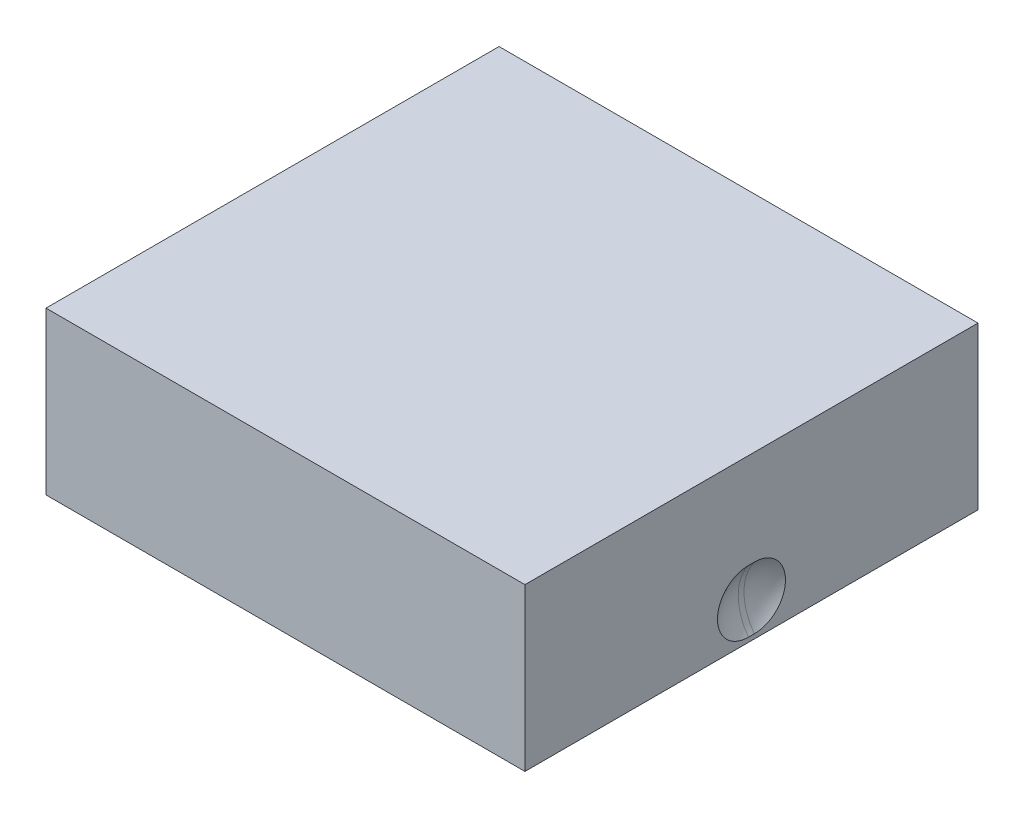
ISO-10303-21;
HEADER;
FILE_DESCRIPTION(('STEP AP214'),'2;1');
FILE_NAME('part.step','',(''),(''),'','','');
FILE_SCHEMA(('AUTOMOTIVE_DESIGN { 1 0 10303 214 1 1 1 1 }'));
ENDSEC;
DATA;
#1=APPLICATION_CONTEXT('core data for automotive mechanical design processes');
#2=APPLICATION_PROTOCOL_DEFINITION('international standard','automotive_design',2000,#1);
#3=PRODUCT_CONTEXT('',#1,'mechanical');
#4=PRODUCT('Part','Part','',(#3));
#5=PRODUCT_RELATED_PRODUCT_CATEGORY('part','',(#4));
#6=PRODUCT_DEFINITION_FORMATION('','',#4);
#7=PRODUCT_DEFINITION_CONTEXT('part definition',#1,'design');
#8=PRODUCT_DEFINITION('design','',#6,#7);
#9=PRODUCT_DEFINITION_SHAPE('','',#8);
#10=(LENGTH_UNIT() NAMED_UNIT(*) SI_UNIT(.MILLI.,.METRE.));
#11=(NAMED_UNIT(*) PLANE_ANGLE_UNIT() SI_UNIT($,.RADIAN.));
#12=(NAMED_UNIT(*) SI_UNIT($,.STERADIAN.) SOLID_ANGLE_UNIT());
#13=UNCERTAINTY_MEASURE_WITH_UNIT(LENGTH_MEASURE(1.E-05),#10,'distance_accuracy_value','');
#14=(GEOMETRIC_REPRESENTATION_CONTEXT(3) GLOBAL_UNCERTAINTY_ASSIGNED_CONTEXT((#13)) GLOBAL_UNIT_ASSIGNED_CONTEXT((#10,
#11,#12)) REPRESENTATION_CONTEXT('',''));
#15=CARTESIAN_POINT('',(0.,0.,0.));
#16=DIRECTION('',(0.,0.,1.));
#17=DIRECTION('',(1.,0.,0.));
#18=AXIS2_PLACEMENT_3D('',#15,#16,#17);
#19=CARTESIAN_POINT('',(50.,120.,0.));
#20=DIRECTION('',(0.,1.,0.));
#21=DIRECTION('',(0.,0.,1.));
#22=AXIS2_PLACEMENT_3D('',#19,#20,#21);
#23=PLANE('',#22);
#24=DIRECTION('',(0.,0.,-1.));
#25=VECTOR('',#24,1.);
#26=CARTESIAN_POINT('',(74.,120.,-70.));
#27=LINE('',#26,#25);
#28=CARTESIAN_POINT('',(74.,120.,-70.));
#29=VERTEX_POINT('',#28);
#30=CARTESIAN_POINT('',(74.,120.,70.));
#31=VERTEX_POINT('',#30);
#32=EDGE_CURVE('E92',#29,#31,#27,.F.);
#33=ORIENTED_EDGE('',*,*,#32,.F.);
#34=DIRECTION('',(-1.,0.,0.));
#35=VECTOR('',#34,1.);
#36=CARTESIAN_POINT('',(-74.,120.,-70.));
#37=LINE('',#36,#35);
#38=CARTESIAN_POINT('',(-74.,120.,-70.));
#39=VERTEX_POINT('',#38);
#40=EDGE_CURVE('E102',#39,#29,#37,.F.);
#41=ORIENTED_EDGE('',*,*,#40,.F.);
#42=DIRECTION('',(0.,0.,1.));
#43=VECTOR('',#42,1.);
#44=CARTESIAN_POINT('',(-74.,120.,70.));
#45=LINE('',#44,#43);
#46=CARTESIAN_POINT('',(-74.,120.,70.));
#47=VERTEX_POINT('',#46);
#48=EDGE_CURVE('E108',#47,#39,#45,.F.);
#49=ORIENTED_EDGE('',*,*,#48,.F.);
#50=DIRECTION('',(1.,0.,0.));
#51=VECTOR('',#50,1.);
#52=CARTESIAN_POINT('',(74.,120.,70.));
#53=LINE('',#52,#51);
#54=EDGE_CURVE('E107',#31,#47,#53,.F.);
#55=ORIENTED_EDGE('',*,*,#54,.F.);
#56=EDGE_LOOP('',(#33,#41,#49,#55));
#57=FACE_BOUND('',#56,.T.);
#58=ADVANCED_FACE('F14',(#57),#23,.T.);
#59=CARTESIAN_POINT('',(50.,115.,0.));
#60=DIRECTION('',(0.,1.,0.));
#61=DIRECTION('',(0.,0.,1.));
#62=AXIS2_PLACEMENT_3D('',#59,#60,#61);
#63=PLANE('',#62);
#64=CARTESIAN_POINT('',(50.,115.,0.));
#65=DIRECTION('',(0.,-1.,0.));
#66=DIRECTION('',(0.,0.,-1.));
#67=AXIS2_PLACEMENT_3D('',#64,#65,#66);
#68=CIRCLE('',#67,9.);
#69=CARTESIAN_POINT('',(50.,115.,-9.));
#70=VERTEX_POINT('',#69);
#71=EDGE_CURVE('E9',#70,#70,#68,.F.);
#72=ORIENTED_EDGE('',*,*,#71,.F.);
#73=EDGE_LOOP('',(#72));
#74=FACE_BOUND('',#73,.T.);
#75=ADVANCED_FACE('F175',(#74),#63,.F.);
#76=CARTESIAN_POINT('',(-50.,115.,0.));
#77=DIRECTION('',(0.,1.,0.));
#78=DIRECTION('',(0.,0.,1.));
#79=AXIS2_PLACEMENT_3D('',#76,#77,#78);
#80=PLANE('',#79);
#81=CARTESIAN_POINT('',(-50.,115.,0.));
#82=DIRECTION('',(0.,1.,0.));
#83=DIRECTION('',(0.,0.,1.));
#84=AXIS2_PLACEMENT_3D('',#81,#82,#83);
#85=CIRCLE('',#84,9.);
#86=CARTESIAN_POINT('',(-50.,115.,9.));
#87=VERTEX_POINT('',#86);
#88=EDGE_CURVE('E23',#87,#87,#85,.T.);
#89=ORIENTED_EDGE('',*,*,#88,.F.);
#90=EDGE_LOOP('',(#89));
#91=FACE_BOUND('',#90,.T.);
#92=ADVANCED_FACE('F172',(#91),#80,.F.);
#93=CARTESIAN_POINT('',(-50.,97.5,0.));
#94=DIRECTION('',(0.,1.,0.));
#95=DIRECTION('',(0.,0.,1.));
#96=AXIS2_PLACEMENT_3D('',#93,#94,#95);
#97=CYLINDRICAL_SURFACE('',#96,9.);
#98=ORIENTED_EDGE('',*,*,#88,.T.);
#99=EDGE_LOOP('',(#98));
#100=FACE_BOUND('',#99,.T.);
#101=CARTESIAN_POINT('',(-50.,80.,0.));
#102=DIRECTION('',(0.,1.,0.));
#103=DIRECTION('',(0.,0.,1.));
#104=AXIS2_PLACEMENT_3D('',#101,#102,#103);
#105=CIRCLE('',#104,9.);
#106=CARTESIAN_POINT('',(-50.,80.,9.));
#107=VERTEX_POINT('',#106);
#108=EDGE_CURVE('E17',#107,#107,#105,.F.);
#109=ORIENTED_EDGE('',*,*,#108,.T.);
#110=EDGE_LOOP('',(#109));
#111=FACE_BOUND('',#110,.T.);
#112=ADVANCED_FACE('F174',(#100,#111),#97,.F.);
#113=CARTESIAN_POINT('',(-57.125,80.,0.));
#114=DIRECTION('',(0.,-1.,0.));
#115=DIRECTION('',(0.,0.,-1.));
#116=AXIS2_PLACEMENT_3D('',#113,#114,#115);
#117=PLANE('',#116);
#118=CARTESIAN_POINT('',(-50.,80.,0.));
#119=DIRECTION('',(0.,1.,0.));
#120=DIRECTION('',(0.,0.,1.));
#121=AXIS2_PLACEMENT_3D('',#118,#119,#120);
#122=CIRCLE('',#121,5.25);
#123=CARTESIAN_POINT('',(-50.,80.,5.25));
#124=VERTEX_POINT('',#123);
#125=EDGE_CURVE('E302',#124,#124,#122,.F.);
#126=ORIENTED_EDGE('',*,*,#125,.T.);
#127=EDGE_LOOP('',(#126));
#128=FACE_BOUND('',#127,.T.);
#129=ORIENTED_EDGE('',*,*,#108,.F.);
#130=EDGE_LOOP('',(#129));
#131=FACE_BOUND('',#130,.T.);
#132=ADVANCED_FACE('F187',(#128,#131),#117,.F.);
#133=CARTESIAN_POINT('',(-50.,72.1,0.));
#134=DIRECTION('',(0.,1.,0.));
#135=DIRECTION('',(0.,0.,1.));
#136=AXIS2_PLACEMENT_3D('',#133,#134,#135);
#137=CYLINDRICAL_SURFACE('',#136,5.25);
#138=ORIENTED_EDGE('',*,*,#125,.F.);
#139=EDGE_LOOP('',(#138));
#140=FACE_BOUND('',#139,.T.);
#141=CARTESIAN_POINT('',(-50.,64.3,0.));
#142=DIRECTION('',(0.,1.,0.));
#143=DIRECTION('',(0.,0.,1.));
#144=AXIS2_PLACEMENT_3D('',#141,#142,#143);
#145=CIRCLE('',#144,5.25);
#146=CARTESIAN_POINT('',(-50.,64.3,5.25));
#147=VERTEX_POINT('',#146);
#148=EDGE_CURVE('E296',#147,#147,#145,.T.);
#149=ORIENTED_EDGE('',*,*,#148,.F.);
#150=EDGE_LOOP('',(#149));
#151=FACE_BOUND('',#150,.T.);
#152=ADVANCED_FACE('F195',(#140,#151),#137,.F.);
#153=CARTESIAN_POINT('',(-54.5,64.3,0.));
#154=DIRECTION('',(0.,-1.,0.));
#155=DIRECTION('',(0.,0.,-1.));
#156=AXIS2_PLACEMENT_3D('',#153,#154,#155);
#157=PLANE('',#156);
#158=CARTESIAN_POINT('',(-50.,64.3,0.));
#159=DIRECTION('',(0.,1.,0.));
#160=DIRECTION('',(0.,0.,1.));
#161=AXIS2_PLACEMENT_3D('',#158,#159,#160);
#162=CIRCLE('',#161,9.);
#163=CARTESIAN_POINT('',(-50.,64.3,9.));
#164=VERTEX_POINT('',#163);
#165=EDGE_CURVE('E284',#164,#164,#162,.T.);
#166=ORIENTED_EDGE('',*,*,#165,.F.);
#167=EDGE_LOOP('',(#166));
#168=FACE_BOUND('',#167,.T.);
#169=ORIENTED_EDGE('',*,*,#148,.T.);
#170=EDGE_LOOP('',(#169));
#171=FACE_BOUND('',#170,.T.);
#172=ADVANCED_FACE('F216',(#168,#171),#157,.T.);
#173=CARTESIAN_POINT('',(-50.,67.15,0.));
#174=DIRECTION('',(0.,1.,0.));
#175=DIRECTION('',(0.,0.,1.));
#176=AXIS2_PLACEMENT_3D('',#173,#174,#175);
#177=CYLINDRICAL_SURFACE('',#176,9.);
#178=ORIENTED_EDGE('',*,*,#165,.T.);
#179=EDGE_LOOP('',(#178));
#180=FACE_BOUND('',#179,.T.);
#181=CARTESIAN_POINT('',(-50.,70.,0.));
#182=DIRECTION('',(0.,1.,0.));
#183=DIRECTION('',(0.,0.,1.));
#184=AXIS2_PLACEMENT_3D('',#181,#182,#183);
#185=CIRCLE('',#184,9.);
#186=CARTESIAN_POINT('',(-50.,70.,9.));
#187=VERTEX_POINT('',#186);
#188=EDGE_CURVE('E120',#187,#187,#185,.F.);
#189=ORIENTED_EDGE('',*,*,#188,.T.);
#190=EDGE_LOOP('',(#189));
#191=FACE_BOUND('',#190,.T.);
#192=ADVANCED_FACE('F224',(#180,#191),#177,.T.);
#193=CARTESIAN_POINT('',(50.,67.15,0.));
#194=DIRECTION('',(0.,-1.,0.));
#195=DIRECTION('',(0.,0.,-1.));
#196=AXIS2_PLACEMENT_3D('',#193,#194,#195);
#197=CYLINDRICAL_SURFACE('',#196,9.);
#198=CARTESIAN_POINT('',(50.,64.3,0.));
#199=DIRECTION('',(0.,-1.,0.));
#200=DIRECTION('',(0.,0.,-1.));
#201=AXIS2_PLACEMENT_3D('',#198,#199,#200);
#202=CIRCLE('',#201,9.);
#203=CARTESIAN_POINT('',(50.,64.3,-9.));
#204=VERTEX_POINT('',#203);
#205=EDGE_CURVE('E98',#204,#204,#202,.F.);
#206=ORIENTED_EDGE('',*,*,#205,.T.);
#207=EDGE_LOOP('',(#206));
#208=FACE_BOUND('',#207,.T.);
#209=CARTESIAN_POINT('',(50.,70.,0.));
#210=DIRECTION('',(0.,-1.,0.));
#211=DIRECTION('',(0.,0.,-1.));
#212=AXIS2_PLACEMENT_3D('',#209,#210,#211);
#213=CIRCLE('',#212,9.);
#214=CARTESIAN_POINT('',(50.,70.,-9.));
#215=VERTEX_POINT('',#214);
#216=EDGE_CURVE('E134',#215,#215,#213,.T.);
#217=ORIENTED_EDGE('',*,*,#216,.T.);
#218=EDGE_LOOP('',(#217));
#219=FACE_BOUND('',#218,.T.);
#220=ADVANCED_FACE('F259',(#208,#219),#197,.T.);
#221=CARTESIAN_POINT('',(-86.8,81.,-0.900000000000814));
#222=DIRECTION('',(0.633979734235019,0.762368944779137,0.129858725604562));
#223=DIRECTION('',(-0.762337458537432,0.644314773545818,-0.0608282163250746));
#224=AXIS2_PLACEMENT_3D('',#221,#222,#223);
#225=SPHERICAL_SURFACE('',#224,16.);
#226=CARTESIAN_POINT('',(-86.8,81.,-0.9));
#227=DIRECTION('',(0.,0.,1.));
#228=DIRECTION('',(1.,0.,0.));
#229=AXIS2_PLACEMENT_3D('',#226,#227,#228);
#230=CIRCLE('',#229,16.);
#231=CARTESIAN_POINT('',(-74.,71.4,-0.9));
#232=VERTEX_POINT('',#231);
#233=CARTESIAN_POINT('',(-74.,90.6,-0.9));
#234=VERTEX_POINT('',#233);
#235=EDGE_CURVE('E285',#232,#234,#230,.T.);
#236=ORIENTED_EDGE('',*,*,#235,.T.);
#237=CARTESIAN_POINT('',(-74.,71.3999999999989,-0.9));
#238=CARTESIAN_POINT('',(-74.,71.3999709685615,-1.1700030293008));
#239=CARTESIAN_POINT('',(-74.,71.4113896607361,-1.44000188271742));
#240=CARTESIAN_POINT('',(-74.,71.4569128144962,-1.97806793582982));
#241=CARTESIAN_POINT('',(-74.,71.491016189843,-2.24613522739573));
#242=CARTESIAN_POINT('',(-74.,71.5816671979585,-2.77825399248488));
#243=CARTESIAN_POINT('',(-74.,71.6381990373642,-3.04230815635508));
#244=CARTESIAN_POINT('',(-74.,71.773295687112,-3.56471500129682));
#245=CARTESIAN_POINT('',(-74.,71.8518602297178,-3.82306775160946));
#246=CARTESIAN_POINT('',(-74.,72.0305080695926,-4.33235682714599));
#247=CARTESIAN_POINT('',(-74.,72.1306012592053,-4.58328968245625));
#248=CARTESIAN_POINT('',(-74.,72.3515750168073,-5.07583571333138));
#249=CARTESIAN_POINT('',(-74.,72.4724560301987,-5.31744868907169));
#250=CARTESIAN_POINT('',(-74.,72.7341176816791,-5.78958271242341));
#251=CARTESIAN_POINT('',(-74.,72.8748942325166,-6.0201060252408));
#252=CARTESIAN_POINT('',(-74.,73.1753642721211,-6.46847415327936));
#253=CARTESIAN_POINT('',(-74.,73.3350576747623,-6.68631902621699));
#254=CARTESIAN_POINT('',(-74.,73.6722327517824,-7.10779034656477));
#255=CARTESIAN_POINT('',(-74.,73.8497150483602,-7.31141629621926));
#256=CARTESIAN_POINT('',(-74.,74.2211976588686,-7.70298975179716));
#257=CARTESIAN_POINT('',(-74.,74.4151976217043,-7.89093759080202));
#258=CARTESIAN_POINT('',(-74.,74.8183728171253,-8.24985305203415));
#259=CARTESIAN_POINT('',(-74.,75.0275505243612,-8.4208178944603));
#260=CARTESIAN_POINT('',(-74.,75.4595657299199,-8.74451672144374));
#261=CARTESIAN_POINT('',(-74.,75.6824032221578,-8.89725071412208));
#262=CARTESIAN_POINT('',(-74.,76.1401435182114,-9.18339562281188));
#263=CARTESIAN_POINT('',(-74.,76.3750457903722,-9.31680738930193));
#264=CARTESIAN_POINT('',(-74.,76.8552545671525,-9.56336732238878));
#265=CARTESIAN_POINT('',(-74.,77.100561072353,-9.67651548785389));
#266=CARTESIAN_POINT('',(-74.,77.5998181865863,-9.88173715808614));
#267=CARTESIAN_POINT('',(-74.,77.853768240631,-9.97381201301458));
#268=CARTESIAN_POINT('',(-74.,78.3685220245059,-10.1362417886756));
#269=CARTESIAN_POINT('',(-74.,78.6293257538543,-10.2065967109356));
#270=CARTESIAN_POINT('',(-74.,79.1559382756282,-10.3250876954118));
#271=CARTESIAN_POINT('',(-74.,79.421747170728,-10.3732233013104));
#272=CARTESIAN_POINT('',(-74.,79.9564751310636,-10.446931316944));
#273=CARTESIAN_POINT('',(-74.,80.2253941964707,-10.472503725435));
#274=CARTESIAN_POINT('',(-74.,80.7644368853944,-10.5009038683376));
#275=CARTESIAN_POINT('',(-74.,81.0345605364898,-10.5037310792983));
#276=CARTESIAN_POINT('',(-74.,81.5740857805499,-10.4866193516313));
#277=CARTESIAN_POINT('',(-74.,81.8434873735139,-10.4666804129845));
#278=CARTESIAN_POINT('',(-74.,82.3796505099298,-10.4041784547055));
#279=CARTESIAN_POINT('',(-74.,82.6464120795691,-10.3616156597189));
#280=CARTESIAN_POINT('',(-74.,83.175401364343,-10.254168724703));
#281=CARTESIAN_POINT('',(-74.,83.4376290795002,-10.1892845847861));
#282=CARTESIAN_POINT('',(-74.,83.9556855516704,-10.0376564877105));
#283=CARTESIAN_POINT('',(-74.,84.2115143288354,-9.95091259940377));
#284=CARTESIAN_POINT('',(-74.,84.7149549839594,-9.75618160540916));
#285=CARTESIAN_POINT('',(-74.,84.9625668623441,-9.64819450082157));
#286=CARTESIAN_POINT('',(-74.,85.4478197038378,-9.41174170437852));
#287=CARTESIAN_POINT('',(-74.,85.6854604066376,-9.28327547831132));
#288=CARTESIAN_POINT('',(-74.,86.1490745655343,-9.00677976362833));
#289=CARTESIAN_POINT('',(-74.,86.3750480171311,-8.85875026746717));
#290=CARTESIAN_POINT('',(-74.,86.8137102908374,-8.5441881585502));
#291=CARTESIAN_POINT('',(-74.,87.0263997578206,-8.3776564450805));
#292=CARTESIAN_POINT('',(-74.,87.4369936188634,-8.02726825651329));
#293=CARTESIAN_POINT('',(-74.,87.6348980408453,-7.8434118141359));
#294=CARTESIAN_POINT('',(-74.,88.0144879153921,-7.45970867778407));
#295=CARTESIAN_POINT('',(-74.,88.1961757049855,-7.25986429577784));
#296=CARTESIAN_POINT('',(-74.,88.5420768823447,-6.84557802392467));
#297=CARTESIAN_POINT('',(-74.,88.7062898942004,-6.63113582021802));
#298=CARTESIAN_POINT('',(-74.,89.0161199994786,-6.18911041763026));
#299=CARTESIAN_POINT('',(-74.,89.1617310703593,-5.96152299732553));
#300=CARTESIAN_POINT('',(-74.,89.433255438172,-5.49489573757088));
#301=CARTESIAN_POINT('',(-74.,89.5591693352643,-5.25585624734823));
#302=CARTESIAN_POINT('',(-74.,89.7904830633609,-4.76786320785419));
#303=CARTESIAN_POINT('',(-74.,89.8958697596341,-4.51890343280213));
#304=CARTESIAN_POINT('',(-74.,90.0852761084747,-4.01299030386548));
#305=CARTESIAN_POINT('',(-74.,90.1692963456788,-3.75603716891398));
#306=CARTESIAN_POINT('',(-74.,90.3152815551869,-3.23630141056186));
#307=CARTESIAN_POINT('',(-74.,90.377274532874,-2.97352664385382));
#308=CARTESIAN_POINT('',(-74.,90.4788912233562,-2.44379460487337));
#309=CARTESIAN_POINT('',(-74.,90.5185259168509,-2.17683945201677));
#310=CARTESIAN_POINT('',(-74.,90.5645706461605,-1.74108609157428));
#311=CARTESIAN_POINT('',(-74.,90.5778651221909,-1.57298540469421));
#312=CARTESIAN_POINT('',(-74.,90.5955734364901,-1.23659564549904));
#313=CARTESIAN_POINT('',(-74.,90.6000019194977,-1.06830734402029));
#314=CARTESIAN_POINT('',(-74.,90.6000000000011,-0.899999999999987));
#315=B_SPLINE_CURVE_WITH_KNOTS('',3,(#237,#238,#239,#240,#241,#242,#243,#244,#245,#246,#247,
#248,#249,#250,#251,#252,#253,#254,#255,#256,#257,#258,#259,#260,#261,#262,#263,#264,#265,#266,
#267,#268,#269,#270,#271,#272,#273,#274,#275,#276,#277,#278,#279,#280,#281,#282,#283,#284,#285,
#286,#287,#288,#289,#290,#291,#292,#293,#294,#295,#296,#297,#298,#299,#300,#301,#302,#303,#304,
#305,#306,#307,#308,#309,#310,#311,#312,#313,#314),.UNSPECIFIED.,.F.,.F.,(4,2,2,2,2,2,2,2,2,2,2,
2,2,2,2,2,2,2,2,2,2,2,2,2,2,2,2,2,2,2,2,2,2,2,2,2,2,2,4),(0.,0.809761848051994,1.61948492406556,
2.42863882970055,3.23778290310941,4.04729957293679,4.8568335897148,5.66620154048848,
6.47556580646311,7.28495839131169,8.09433377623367,8.9038414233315,9.71334870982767,
10.522820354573,11.3322920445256,12.1417118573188,12.9511316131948,13.760567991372,
14.5700044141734,15.3794594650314,16.1889145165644,16.9983615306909,17.8078085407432,
18.6172530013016,19.4266974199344,20.2361629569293,21.0456288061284,21.8550553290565,
22.6644803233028,23.4737884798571,24.2831140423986,25.0927009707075,25.9022632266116,
26.7123418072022,27.5223982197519,28.3314210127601,29.1400461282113,29.6457079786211,
30.1505338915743),.UNSPECIFIED.);
#316=EDGE_CURVE('E114',#232,#234,#315,.T.);
#317=ORIENTED_EDGE('',*,*,#316,.F.);
#318=EDGE_LOOP('',(#236,#317));
#319=FACE_BOUND('',#318,.T.);
#320=ADVANCED_FACE('F244',(#319),#225,.F.);
#321=CARTESIAN_POINT('',(-86.8,81.,0.900000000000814));
#322=DIRECTION('',(0.633979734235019,0.762368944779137,0.129858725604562));
#323=DIRECTION('',(-0.762337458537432,0.644314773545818,-0.0608282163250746));
#324=AXIS2_PLACEMENT_3D('',#321,#322,#323);
#325=SPHERICAL_SURFACE('',#324,16.);
#326=CARTESIAN_POINT('',(-86.8,81.,0.9));
#327=DIRECTION('',(0.,0.,1.));
#328=DIRECTION('',(1.,0.,0.));
#329=AXIS2_PLACEMENT_3D('',#326,#327,#328);
#330=CIRCLE('',#329,16.);
#331=CARTESIAN_POINT('',(-74.,71.4,0.9));
#332=VERTEX_POINT('',#331);
#333=CARTESIAN_POINT('',(-74.,90.6,0.9));
#334=VERTEX_POINT('',#333);
#335=EDGE_CURVE('E281',#332,#334,#330,.T.);
#336=ORIENTED_EDGE('',*,*,#335,.F.);
#337=CARTESIAN_POINT('',(-74.,90.6000000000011,0.9));
#338=CARTESIAN_POINT('',(-74.,90.6000290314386,1.17000302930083));
#339=CARTESIAN_POINT('',(-74.,90.588610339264,1.44000188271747));
#340=CARTESIAN_POINT('',(-74.,90.5430871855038,1.97806793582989));
#341=CARTESIAN_POINT('',(-74.,90.5089838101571,2.24613522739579));
#342=CARTESIAN_POINT('',(-74.,90.4183328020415,2.77825399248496));
#343=CARTESIAN_POINT('',(-74.,90.3618009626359,3.04230815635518));
#344=CARTESIAN_POINT('',(-74.,90.2267043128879,3.56471500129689));
#345=CARTESIAN_POINT('',(-74.,90.1481397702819,3.82306775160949));
#346=CARTESIAN_POINT('',(-74.,89.9694919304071,4.33235682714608));
#347=CARTESIAN_POINT('',(-74.,89.8693987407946,4.58328968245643));
#348=CARTESIAN_POINT('',(-74.,89.6484249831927,5.07583571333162));
#349=CARTESIAN_POINT('',(-74.,89.5275439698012,5.3174486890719));
#350=CARTESIAN_POINT('',(-74.,89.2658823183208,5.78958271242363));
#351=CARTESIAN_POINT('',(-74.,89.1251057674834,6.02010602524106));
#352=CARTESIAN_POINT('',(-74.,88.8246357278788,6.46847415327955));
#353=CARTESIAN_POINT('',(-74.,88.6649423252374,6.68631902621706));
#354=CARTESIAN_POINT('',(-74.,88.3277672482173,7.10779034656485));
#355=CARTESIAN_POINT('',(-74.,88.1502849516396,7.31141629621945));
#356=CARTESIAN_POINT('',(-74.,87.7788023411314,7.70298975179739));
#357=CARTESIAN_POINT('',(-74.,87.5848023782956,7.89093759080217));
#358=CARTESIAN_POINT('',(-74.,87.1816271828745,8.24985305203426));
#359=CARTESIAN_POINT('',(-74.,86.9724494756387,8.42081789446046));
#360=CARTESIAN_POINT('',(-74.,86.54043427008,8.74451672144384));
#361=CARTESIAN_POINT('',(-74.,86.317596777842,8.89725071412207));
#362=CARTESIAN_POINT('',(-74.,85.8598564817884,9.18339562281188));
#363=CARTESIAN_POINT('',(-74.,85.6249542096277,9.31680738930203));
#364=CARTESIAN_POINT('',(-74.,85.1447454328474,9.56336732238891));
#365=CARTESIAN_POINT('',(-74.,84.8994389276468,9.67651548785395));
#366=CARTESIAN_POINT('',(-74.,84.4001818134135,9.88173715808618));
#367=CARTESIAN_POINT('',(-74.,84.1462317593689,9.97381201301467));
#368=CARTESIAN_POINT('',(-74.,83.631477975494,10.1362417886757));
#369=CARTESIAN_POINT('',(-74.,83.3706742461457,10.2065967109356));
#370=CARTESIAN_POINT('',(-74.,82.8440617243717,10.3250876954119));
#371=CARTESIAN_POINT('',(-74.,82.5782528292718,10.3732233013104));
#372=CARTESIAN_POINT('',(-74.,82.0435248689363,10.446931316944));
#373=CARTESIAN_POINT('',(-74.,81.7746058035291,10.472503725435));
#374=CARTESIAN_POINT('',(-74.,81.2355631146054,10.5009038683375));
#375=CARTESIAN_POINT('',(-74.,80.96543946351,10.5037310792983));
#376=CARTESIAN_POINT('',(-74.,80.4259142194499,10.4866193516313));
#377=CARTESIAN_POINT('',(-74.,80.1565126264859,10.4666804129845));
#378=CARTESIAN_POINT('',(-74.,79.62034949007,10.4041784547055));
#379=CARTESIAN_POINT('',(-74.,79.3535879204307,10.3616156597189));
#380=CARTESIAN_POINT('',(-74.,78.8245986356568,10.254168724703));
#381=CARTESIAN_POINT('',(-74.,78.5623709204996,10.189284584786));
#382=CARTESIAN_POINT('',(-74.,78.0443144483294,10.0376564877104));
#383=CARTESIAN_POINT('',(-74.,77.7884856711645,9.95091259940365));
#384=CARTESIAN_POINT('',(-74.,77.2850450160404,9.75618160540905));
#385=CARTESIAN_POINT('',(-74.,77.0374331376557,9.6481945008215));
#386=CARTESIAN_POINT('',(-74.,76.552180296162,9.41174170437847));
#387=CARTESIAN_POINT('',(-74.,76.3145395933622,9.28327547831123));
#388=CARTESIAN_POINT('',(-74.,75.8509254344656,9.0067797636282));
#389=CARTESIAN_POINT('',(-74.,75.6249519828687,8.85875026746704));
#390=CARTESIAN_POINT('',(-74.,75.1862897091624,8.54418815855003));
#391=CARTESIAN_POINT('',(-74.,74.9736002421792,8.3776564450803));
#392=CARTESIAN_POINT('',(-74.,74.5630063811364,8.02726825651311));
#393=CARTESIAN_POINT('',(-74.,74.3651019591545,7.84341181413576));
#394=CARTESIAN_POINT('',(-74.,73.9855120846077,7.45970867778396));
#395=CARTESIAN_POINT('',(-74.,73.8038242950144,7.2598642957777));
#396=CARTESIAN_POINT('',(-74.,73.4579231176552,6.8455780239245));
#397=CARTESIAN_POINT('',(-74.,73.2937101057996,6.63113582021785));
#398=CARTESIAN_POINT('',(-74.,72.9838800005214,6.18911041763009));
#399=CARTESIAN_POINT('',(-74.,72.8382689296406,5.96152299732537));
#400=CARTESIAN_POINT('',(-74.,72.5667445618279,5.49489573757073));
#401=CARTESIAN_POINT('',(-74.,72.4408306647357,5.25585624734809));
#402=CARTESIAN_POINT('',(-74.,72.2095169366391,4.76786320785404));
#403=CARTESIAN_POINT('',(-74.,72.1041302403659,4.51890343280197));
#404=CARTESIAN_POINT('',(-74.,71.9147238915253,4.01299030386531));
#405=CARTESIAN_POINT('',(-74.,71.8307036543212,3.75603716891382));
#406=CARTESIAN_POINT('',(-74.,71.684718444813,3.23630141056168));
#407=CARTESIAN_POINT('',(-74.,71.622725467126,2.97352664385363));
#408=CARTESIAN_POINT('',(-74.,71.5211087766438,2.44379460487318));
#409=CARTESIAN_POINT('',(-74.,71.481474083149,2.17683945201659));
#410=CARTESIAN_POINT('',(-74.,71.4354293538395,1.74108609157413));
#411=CARTESIAN_POINT('',(-74.,71.4221348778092,1.57298540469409));
#412=CARTESIAN_POINT('',(-74.,71.40442656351,1.23659564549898));
#413=CARTESIAN_POINT('',(-74.,71.3999980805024,1.06830734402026));
#414=CARTESIAN_POINT('',(-74.,71.3999999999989,0.9));
#415=B_SPLINE_CURVE_WITH_KNOTS('',3,(#337,#338,#339,#340,#341,#342,#343,#344,#345,#346,#347,
#348,#349,#350,#351,#352,#353,#354,#355,#356,#357,#358,#359,#360,#361,#362,#363,#364,#365,#366,
#367,#368,#369,#370,#371,#372,#373,#374,#375,#376,#377,#378,#379,#380,#381,#382,#383,#384,#385,
#386,#387,#388,#389,#390,#391,#392,#393,#394,#395,#396,#397,#398,#399,#400,#401,#402,#403,#404,
#405,#406,#407,#408,#409,#410,#411,#412,#413,#414),.UNSPECIFIED.,.F.,.F.,(4,2,2,2,2,2,2,2,2,2,2,
2,2,2,2,2,2,2,2,2,2,2,2,2,2,2,2,2,2,2,2,2,2,2,2,2,2,2,4),(0.,0.80976184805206,1.61948492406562,
2.42863882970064,3.23778290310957,4.04729957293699,4.85683358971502,5.6662015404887,
6.47556580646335,7.2849583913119,8.09433377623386,8.90384142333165,9.71334870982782,
10.5228203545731,11.3322920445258,12.1417118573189,12.9511316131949,13.7605679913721,
14.5700044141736,15.3794594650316,16.1889145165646,16.9983615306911,17.8078085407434,
18.6172530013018,19.4266974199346,20.2361629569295,21.0456288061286,21.8550553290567,
22.664480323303,23.4737884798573,24.2831140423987,25.0927009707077,25.9022632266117,
26.7123418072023,27.522398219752,28.3314210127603,29.1400461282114,29.6457079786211,
30.1505338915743),.UNSPECIFIED.);
#416=EDGE_CURVE('E111',#334,#332,#415,.T.);
#417=ORIENTED_EDGE('',*,*,#416,.F.);
#418=EDGE_LOOP('',(#336,#417));
#419=FACE_BOUND('',#418,.T.);
#420=ADVANCED_FACE('F152',(#419),#325,.F.);
#421=CARTESIAN_POINT('',(-86.8,81.,0.));
#422=DIRECTION('',(0.,0.,1.));
#423=DIRECTION('',(1.,0.,0.));
#424=AXIS2_PLACEMENT_3D('',#421,#422,#423);
#425=CYLINDRICAL_SURFACE('',#424,16.);
#426=ORIENTED_EDGE('',*,*,#235,.F.);
#427=DIRECTION('',(0.,0.,1.));
#428=VECTOR('',#427,1.);
#429=CARTESIAN_POINT('',(-74.,71.4,70.));
#430=LINE('',#429,#428);
#431=EDGE_CURVE('E101',#332,#232,#430,.F.);
#432=ORIENTED_EDGE('',*,*,#431,.F.);
#433=ORIENTED_EDGE('',*,*,#335,.T.);
#434=DIRECTION('',(0.,0.,1.));
#435=VECTOR('',#434,1.);
#436=CARTESIAN_POINT('',(-74.,90.6,70.));
#437=LINE('',#436,#435);
#438=EDGE_CURVE('E112',#234,#334,#437,.T.);
#439=ORIENTED_EDGE('',*,*,#438,.F.);
#440=EDGE_LOOP('',(#426,#432,#433,#439));
#441=FACE_BOUND('',#440,.T.);
#442=ADVANCED_FACE('F234',(#441),#425,.F.);
#443=CARTESIAN_POINT('',(86.8,81.,0.900000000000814));
#444=DIRECTION('',(0.633979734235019,0.762368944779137,0.129858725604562));
#445=DIRECTION('',(-0.762337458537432,0.644314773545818,-0.0608282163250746));
#446=AXIS2_PLACEMENT_3D('',#443,#444,#445);
#447=SPHERICAL_SURFACE('',#446,16.);
#448=CARTESIAN_POINT('',(86.8,81.,0.9));
#449=DIRECTION('',(0.,0.,-1.));
#450=DIRECTION('',(-1.,0.,0.));
#451=AXIS2_PLACEMENT_3D('',#448,#449,#450);
#452=CIRCLE('',#451,16.);
#453=CARTESIAN_POINT('',(74.,71.4,0.9));
#454=VERTEX_POINT('',#453);
#455=CARTESIAN_POINT('',(74.,90.6,0.9));
#456=VERTEX_POINT('',#455);
#457=EDGE_CURVE('E71',#454,#456,#452,.T.);
#458=ORIENTED_EDGE('',*,*,#457,.T.);
#459=CARTESIAN_POINT('',(74.,71.3999999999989,0.9));
#460=CARTESIAN_POINT('',(74.,71.3999709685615,1.17000302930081));
#461=CARTESIAN_POINT('',(74.,71.4113896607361,1.44000188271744));
#462=CARTESIAN_POINT('',(74.,71.4569128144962,1.97806793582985));
#463=CARTESIAN_POINT('',(74.,71.4910161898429,2.24613522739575));
#464=CARTESIAN_POINT('',(74.,71.5816671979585,2.77825399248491));
#465=CARTESIAN_POINT('',(74.,71.6381990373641,3.04230815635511));
#466=CARTESIAN_POINT('',(74.,71.7732956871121,3.56471500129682));
#467=CARTESIAN_POINT('',(74.,71.851860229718,3.82306775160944));
#468=CARTESIAN_POINT('',(74.,72.0305080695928,4.332356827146));
#469=CARTESIAN_POINT('',(74.,72.1306012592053,4.58328968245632));
#470=CARTESIAN_POINT('',(74.,72.3515750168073,5.07583571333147));
#471=CARTESIAN_POINT('',(74.,72.4724560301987,5.31744868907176));
#472=CARTESIAN_POINT('',(74.,72.7341176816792,5.78958271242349));
#473=CARTESIAN_POINT('',(74.,72.8748942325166,6.02010602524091));
#474=CARTESIAN_POINT('',(74.,73.1753642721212,6.46847415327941));
#475=CARTESIAN_POINT('',(74.,73.3350576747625,6.68631902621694));
#476=CARTESIAN_POINT('',(74.,73.6722327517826,7.10779034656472));
#477=CARTESIAN_POINT('',(74.,73.8497150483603,7.31141629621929));
#478=CARTESIAN_POINT('',(74.,74.2211976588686,7.70298975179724));
#479=CARTESIAN_POINT('',(74.,74.4151976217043,7.89093759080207));
#480=CARTESIAN_POINT('',(74.,74.8183728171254,8.24985305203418));
#481=CARTESIAN_POINT('',(74.,75.0275505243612,8.42081789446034));
#482=CARTESIAN_POINT('',(74.,75.4595657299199,8.74451672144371));
#483=CARTESIAN_POINT('',(74.,75.6824032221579,8.89725071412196));
#484=CARTESIAN_POINT('',(74.,76.1401435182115,9.1833956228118));
#485=CARTESIAN_POINT('',(74.,76.3750457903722,9.31680738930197));
#486=CARTESIAN_POINT('',(74.,76.8552545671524,9.56336732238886));
#487=CARTESIAN_POINT('',(74.,77.1005610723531,9.67651548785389));
#488=CARTESIAN_POINT('',(74.,77.5998181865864,9.88173715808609));
#489=CARTESIAN_POINT('',(74.,77.853768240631,9.97381201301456));
#490=CARTESIAN_POINT('',(74.,78.3685220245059,10.1362417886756));
#491=CARTESIAN_POINT('',(74.,78.6293257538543,10.2065967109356));
#492=CARTESIAN_POINT('',(74.,79.1559382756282,10.3250876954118));
#493=CARTESIAN_POINT('',(74.,79.421747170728,10.3732233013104));
#494=CARTESIAN_POINT('',(74.,79.9564751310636,10.446931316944));
#495=CARTESIAN_POINT('',(74.,80.2253941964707,10.472503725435));
#496=CARTESIAN_POINT('',(74.,80.7644368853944,10.5009038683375));
#497=CARTESIAN_POINT('',(74.,81.0345605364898,10.5037310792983));
#498=CARTESIAN_POINT('',(74.,81.5740857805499,10.4866193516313));
#499=CARTESIAN_POINT('',(74.,81.8434873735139,10.4666804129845));
#500=CARTESIAN_POINT('',(74.,82.3796505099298,10.4041784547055));
#501=CARTESIAN_POINT('',(74.,82.6464120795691,10.3616156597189));
#502=CARTESIAN_POINT('',(74.,83.175401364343,10.254168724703));
#503=CARTESIAN_POINT('',(74.,83.4376290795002,10.1892845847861));
#504=CARTESIAN_POINT('',(74.,83.9556855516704,10.0376564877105));
#505=CARTESIAN_POINT('',(74.,84.2115143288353,9.95091259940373));
#506=CARTESIAN_POINT('',(74.,84.7149549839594,9.75618160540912));
#507=CARTESIAN_POINT('',(74.,84.9625668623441,9.64819450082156));
#508=CARTESIAN_POINT('',(74.,85.4478197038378,9.41174170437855));
#509=CARTESIAN_POINT('',(74.,85.6854604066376,9.28327547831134));
#510=CARTESIAN_POINT('',(74.,86.1490745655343,9.00677976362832));
#511=CARTESIAN_POINT('',(74.,86.3750480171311,8.85875026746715));
#512=CARTESIAN_POINT('',(74.,86.8137102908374,8.54418815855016));
#513=CARTESIAN_POINT('',(74.,87.0263997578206,8.37765644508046));
#514=CARTESIAN_POINT('',(74.,87.4369936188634,8.02726825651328));
#515=CARTESIAN_POINT('',(74.,87.6348980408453,7.8434118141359));
#516=CARTESIAN_POINT('',(74.,88.0144879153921,7.4597086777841));
#517=CARTESIAN_POINT('',(74.,88.1961757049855,7.25986429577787));
#518=CARTESIAN_POINT('',(74.,88.5420768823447,6.84557802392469));
#519=CARTESIAN_POINT('',(74.,88.7062898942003,6.63113582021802));
#520=CARTESIAN_POINT('',(74.,89.0161199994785,6.18911041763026));
#521=CARTESIAN_POINT('',(74.,89.1617310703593,5.96152299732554));
#522=CARTESIAN_POINT('',(74.,89.433255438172,5.4948957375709));
#523=CARTESIAN_POINT('',(74.,89.5591693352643,5.25585624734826));
#524=CARTESIAN_POINT('',(74.,89.7904830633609,4.76786320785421));
#525=CARTESIAN_POINT('',(74.,89.8958697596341,4.51890343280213));
#526=CARTESIAN_POINT('',(74.,90.0852761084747,4.01299030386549));
#527=CARTESIAN_POINT('',(74.,90.1692963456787,3.75603716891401));
#528=CARTESIAN_POINT('',(74.,90.3152815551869,3.23630141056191));
#529=CARTESIAN_POINT('',(74.,90.3772745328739,2.97352664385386));
#530=CARTESIAN_POINT('',(74.,90.4788912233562,2.44379460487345));
#531=CARTESIAN_POINT('',(74.,90.5185259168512,2.1768394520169));
#532=CARTESIAN_POINT('',(74.,90.5645706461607,1.74108609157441));
#533=CARTESIAN_POINT('',(74.,90.5778651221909,1.57298540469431));
#534=CARTESIAN_POINT('',(74.,90.5955734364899,1.23659564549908));
#535=CARTESIAN_POINT('',(74.,90.6000019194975,1.0683073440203));
#536=CARTESIAN_POINT('',(74.,90.6000000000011,0.9));
#537=B_SPLINE_CURVE_WITH_KNOTS('',3,(#459,#460,#461,#462,#463,#464,#465,#466,#467,#468,#469,
#470,#471,#472,#473,#474,#475,#476,#477,#478,#479,#480,#481,#482,#483,#484,#485,#486,#487,#488,
#489,#490,#491,#492,#493,#494,#495,#496,#497,#498,#499,#500,#501,#502,#503,#504,#505,#506,#507,
#508,#509,#510,#511,#512,#513,#514,#515,#516,#517,#518,#519,#520,#521,#522,#523,#524,#525,#526,
#527,#528,#529,#530,#531,#532,#533,#534,#535,#536),.UNSPECIFIED.,.F.,.F.,(4,2,2,2,2,2,2,2,2,2,2,
2,2,2,2,2,2,2,2,2,2,2,2,2,2,2,2,2,2,2,2,2,2,2,2,2,2,2,4),(0.,0.809761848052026,1.61948492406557,
2.42863882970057,3.23778290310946,4.04729957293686,4.85683358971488,5.66620154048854,
6.47556580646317,7.28495839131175,8.0943337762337,8.9038414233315,9.71334870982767,
10.522820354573,11.3322920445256,12.1417118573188,12.9511316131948,13.7605679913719,
14.5700044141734,15.3794594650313,16.1889145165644,16.9983615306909,17.8078085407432,
18.6172530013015,19.4266974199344,20.2361629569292,21.0456288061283,21.8550553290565,
22.6644803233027,23.473788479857,24.2831140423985,25.0927009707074,25.9022632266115,
26.7123418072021,27.5223982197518,28.33142101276,29.1400461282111,29.6457079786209,
30.1505338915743),.UNSPECIFIED.);
#538=EDGE_CURVE('E76',#454,#456,#537,.T.);
#539=ORIENTED_EDGE('',*,*,#538,.F.);
#540=EDGE_LOOP('',(#458,#539));
#541=FACE_BOUND('',#540,.T.);
#542=ADVANCED_FACE('F84',(#541),#447,.F.);
#543=CARTESIAN_POINT('',(86.8,81.,-0.900000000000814));
#544=DIRECTION('',(0.633979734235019,0.762368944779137,0.129858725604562));
#545=DIRECTION('',(-0.762337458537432,0.644314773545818,-0.0608282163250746));
#546=AXIS2_PLACEMENT_3D('',#543,#544,#545);
#547=SPHERICAL_SURFACE('',#546,16.);
#548=CARTESIAN_POINT('',(86.8,81.,-0.9));
#549=DIRECTION('',(0.,0.,-1.));
#550=DIRECTION('',(-1.,0.,0.));
#551=AXIS2_PLACEMENT_3D('',#548,#549,#550);
#552=CIRCLE('',#551,16.);
#553=CARTESIAN_POINT('',(74.,71.4,-0.9));
#554=VERTEX_POINT('',#553);
#555=CARTESIAN_POINT('',(74.,90.6,-0.9));
#556=VERTEX_POINT('',#555);
#557=EDGE_CURVE('E85',#554,#556,#552,.T.);
#558=ORIENTED_EDGE('',*,*,#557,.F.);
#559=CARTESIAN_POINT('',(74.,90.6000000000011,-0.9));
#560=CARTESIAN_POINT('',(74.,90.6000290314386,-1.17000302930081));
#561=CARTESIAN_POINT('',(74.,90.588610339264,-1.44000188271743));
#562=CARTESIAN_POINT('',(74.,90.5430871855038,-1.97806793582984));
#563=CARTESIAN_POINT('',(74.,90.5089838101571,-2.24613522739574));
#564=CARTESIAN_POINT('',(74.,90.4183328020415,-2.77825399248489));
#565=CARTESIAN_POINT('',(74.,90.3618009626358,-3.04230815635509));
#566=CARTESIAN_POINT('',(74.,90.226704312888,-3.56471500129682));
#567=CARTESIAN_POINT('',(74.,90.1481397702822,-3.82306775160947));
#568=CARTESIAN_POINT('',(74.,89.9694919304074,-4.33235682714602));
#569=CARTESIAN_POINT('',(74.,89.8693987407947,-4.58328968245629));
#570=CARTESIAN_POINT('',(74.,89.6484249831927,-5.07583571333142));
#571=CARTESIAN_POINT('',(74.,89.5275439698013,-5.31744868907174));
#572=CARTESIAN_POINT('',(74.,89.2658823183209,-5.78958271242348));
#573=CARTESIAN_POINT('',(74.,89.1251057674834,-6.02010602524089));
#574=CARTESIAN_POINT('',(74.,88.8246357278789,-6.46847415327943));
#575=CARTESIAN_POINT('',(74.,88.6649423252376,-6.68631902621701));
#576=CARTESIAN_POINT('',(74.,88.3277672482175,-7.10779034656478));
#577=CARTESIAN_POINT('',(74.,88.1502849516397,-7.3114162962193));
#578=CARTESIAN_POINT('',(74.,87.7788023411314,-7.70298975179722));
#579=CARTESIAN_POINT('',(74.,87.5848023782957,-7.89093759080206));
#580=CARTESIAN_POINT('',(74.,87.1816271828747,-8.24985305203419));
#581=CARTESIAN_POINT('',(74.,86.9724494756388,-8.42081789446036));
#582=CARTESIAN_POINT('',(74.,86.5404342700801,-8.74451672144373));
#583=CARTESIAN_POINT('',(74.,86.3175967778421,-8.89725071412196));
#584=CARTESIAN_POINT('',(74.,85.8598564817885,-9.18339562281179));
#585=CARTESIAN_POINT('',(74.,85.6249542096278,-9.31680738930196));
#586=CARTESIAN_POINT('',(74.,85.1447454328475,-9.56336732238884));
#587=CARTESIAN_POINT('',(74.,84.8994389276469,-9.67651548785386));
#588=CARTESIAN_POINT('',(74.,84.4001818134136,-9.88173715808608));
#589=CARTESIAN_POINT('',(74.,84.146231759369,-9.97381201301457));
#590=CARTESIAN_POINT('',(74.,83.6314779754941,-10.1362417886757));
#591=CARTESIAN_POINT('',(74.,83.3706742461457,-10.2065967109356));
#592=CARTESIAN_POINT('',(74.,82.8440617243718,-10.3250876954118));
#593=CARTESIAN_POINT('',(74.,82.578252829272,-10.3732233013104));
#594=CARTESIAN_POINT('',(74.,82.0435248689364,-10.446931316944));
#595=CARTESIAN_POINT('',(74.,81.7746058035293,-10.472503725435));
#596=CARTESIAN_POINT('',(74.,81.2355631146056,-10.5009038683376));
#597=CARTESIAN_POINT('',(74.,80.9654394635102,-10.5037310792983));
#598=CARTESIAN_POINT('',(74.,80.4259142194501,-10.4866193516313));
#599=CARTESIAN_POINT('',(74.,80.1565126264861,-10.4666804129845));
#600=CARTESIAN_POINT('',(74.,79.6203494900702,-10.4041784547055));
#601=CARTESIAN_POINT('',(74.,79.3535879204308,-10.3616156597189));
#602=CARTESIAN_POINT('',(74.,78.824598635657,-10.254168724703));
#603=CARTESIAN_POINT('',(74.,78.5623709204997,-10.1892845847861));
#604=CARTESIAN_POINT('',(74.,78.0443144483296,-10.0376564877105));
#605=CARTESIAN_POINT('',(74.,77.7884856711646,-9.95091259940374));
#606=CARTESIAN_POINT('',(74.,77.2850450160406,-9.75618160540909));
#607=CARTESIAN_POINT('',(74.,77.0374331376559,-9.6481945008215));
#608=CARTESIAN_POINT('',(74.,76.5521802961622,-9.41174170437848));
#609=CARTESIAN_POINT('',(74.,76.3145395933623,-9.28327547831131));
#610=CARTESIAN_POINT('',(74.,75.8509254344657,-9.00677976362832));
#611=CARTESIAN_POINT('',(74.,75.6249519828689,-8.85875026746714));
#612=CARTESIAN_POINT('',(74.,75.1862897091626,-8.54418815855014));
#613=CARTESIAN_POINT('',(74.,74.9736002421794,-8.37765644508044));
#614=CARTESIAN_POINT('',(74.,74.5630063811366,-8.02726825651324));
#615=CARTESIAN_POINT('',(74.,74.3651019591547,-7.84341181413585));
#616=CARTESIAN_POINT('',(74.,73.9855120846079,-7.45970867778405));
#617=CARTESIAN_POINT('',(74.,73.8038242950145,-7.25986429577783));
#618=CARTESIAN_POINT('',(74.,73.4579231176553,-6.84557802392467));
#619=CARTESIAN_POINT('',(74.,73.2937101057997,-6.63113582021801));
#620=CARTESIAN_POINT('',(74.,72.9838800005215,-6.18911041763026));
#621=CARTESIAN_POINT('',(74.,72.8382689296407,-5.96152299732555));
#622=CARTESIAN_POINT('',(74.,72.566744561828,-5.49489573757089));
#623=CARTESIAN_POINT('',(74.,72.4408306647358,-5.25585624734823));
#624=CARTESIAN_POINT('',(74.,72.2095169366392,-4.76786320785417));
#625=CARTESIAN_POINT('',(74.,72.104130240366,-4.51890343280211));
#626=CARTESIAN_POINT('',(74.,71.9147238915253,-4.01299030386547));
#627=CARTESIAN_POINT('',(74.,71.8307036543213,-3.75603716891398));
#628=CARTESIAN_POINT('',(74.,71.6847184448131,-3.23630141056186));
#629=CARTESIAN_POINT('',(74.,71.622725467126,-2.97352664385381));
#630=CARTESIAN_POINT('',(74.,71.5211087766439,-2.44379460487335));
#631=CARTESIAN_POINT('',(74.,71.4814740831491,-2.17683945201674));
#632=CARTESIAN_POINT('',(74.,71.4354293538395,-1.74108609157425));
#633=CARTESIAN_POINT('',(74.,71.4221348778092,-1.57298540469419));
#634=CARTESIAN_POINT('',(74.,71.40442656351,-1.23659564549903));
#635=CARTESIAN_POINT('',(74.,71.3999980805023,-1.06830734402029));
#636=CARTESIAN_POINT('',(74.,71.3999999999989,-0.9));
#637=B_SPLINE_CURVE_WITH_KNOTS('',3,(#559,#560,#561,#562,#563,#564,#565,#566,#567,#568,#569,
#570,#571,#572,#573,#574,#575,#576,#577,#578,#579,#580,#581,#582,#583,#584,#585,#586,#587,#588,
#589,#590,#591,#592,#593,#594,#595,#596,#597,#598,#599,#600,#601,#602,#603,#604,#605,#606,#607,
#608,#609,#610,#611,#612,#613,#614,#615,#616,#617,#618,#619,#620,#621,#622,#623,#624,#625,#626,
#627,#628,#629,#630,#631,#632,#633,#634,#635,#636),.UNSPECIFIED.,.F.,.F.,(4,2,2,2,2,2,2,2,2,2,2,
2,2,2,2,2,2,2,2,2,2,2,2,2,2,2,2,2,2,2,2,2,2,2,2,2,2,2,4),(0.,0.809761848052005,1.61948492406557,
2.42863882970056,3.23778290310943,4.04729957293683,4.85683358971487,5.66620154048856,
6.4755658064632,7.28495839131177,8.09433377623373,8.90384142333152,9.71334870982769,
10.522820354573,11.3322920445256,12.1417118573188,12.9511316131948,13.760567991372,
14.5700044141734,15.3794594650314,16.1889145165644,16.9983615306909,17.8078085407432,
18.6172530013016,19.4266974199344,20.2361629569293,21.0456288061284,21.8550553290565,
22.6644803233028,23.4737884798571,24.2831140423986,25.0927009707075,25.9022632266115,
26.7123418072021,27.5223982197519,28.3314210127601,29.1400461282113,29.645707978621,
30.1505338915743),.UNSPECIFIED.);
#638=EDGE_CURVE('E90',#556,#554,#637,.T.);
#639=ORIENTED_EDGE('',*,*,#638,.F.);
#640=EDGE_LOOP('',(#558,#639));
#641=FACE_BOUND('',#640,.T.);
#642=ADVANCED_FACE('F233',(#641),#547,.F.);
#643=CARTESIAN_POINT('',(86.8,81.,0.));
#644=DIRECTION('',(0.,0.,-1.));
#645=DIRECTION('',(-1.,0.,0.));
#646=AXIS2_PLACEMENT_3D('',#643,#644,#645);
#647=CYLINDRICAL_SURFACE('',#646,16.);
#648=ORIENTED_EDGE('',*,*,#457,.F.);
#649=DIRECTION('',(0.,0.,-1.));
#650=VECTOR('',#649,1.);
#651=CARTESIAN_POINT('',(74.,71.4,-70.));
#652=LINE('',#651,#650);
#653=EDGE_CURVE('E81',#554,#454,#652,.F.);
#654=ORIENTED_EDGE('',*,*,#653,.F.);
#655=ORIENTED_EDGE('',*,*,#557,.T.);
#656=DIRECTION('',(0.,0.,-1.));
#657=VECTOR('',#656,1.);
#658=CARTESIAN_POINT('',(74.,90.6,-70.));
#659=LINE('',#658,#657);
#660=EDGE_CURVE('E79',#456,#556,#659,.T.);
#661=ORIENTED_EDGE('',*,*,#660,.F.);
#662=EDGE_LOOP('',(#648,#654,#655,#661));
#663=FACE_BOUND('',#662,.T.);
#664=ADVANCED_FACE('F88',(#663),#647,.F.);
#665=CARTESIAN_POINT('',(0.,70.,0.));
#666=DIRECTION('',(0.,1.,0.));
#667=DIRECTION('',(0.,0.,1.));
#668=AXIS2_PLACEMENT_3D('',#665,#666,#667);
#669=PLANE('',#668);
#670=DIRECTION('',(0.,0.,1.));
#671=VECTOR('',#670,1.);
#672=CARTESIAN_POINT('',(-74.,70.,0.));
#673=LINE('',#672,#671);
#674=CARTESIAN_POINT('',(-74.,70.,-70.));
#675=VERTEX_POINT('',#674);
#676=CARTESIAN_POINT('',(-74.,70.,70.));
#677=VERTEX_POINT('',#676);
#678=EDGE_CURVE('E125',#675,#677,#673,.T.);
#679=ORIENTED_EDGE('',*,*,#678,.F.);
#680=DIRECTION('',(1.,0.,0.));
#681=VECTOR('',#680,1.);
#682=CARTESIAN_POINT('',(0.,70.,-70.));
#683=LINE('',#682,#681);
#684=CARTESIAN_POINT('',(74.,70.,-70.));
#685=VERTEX_POINT('',#684);
#686=EDGE_CURVE('E128',#685,#675,#683,.F.);
#687=ORIENTED_EDGE('',*,*,#686,.F.);
#688=DIRECTION('',(0.,0.,1.));
#689=VECTOR('',#688,1.);
#690=CARTESIAN_POINT('',(74.,70.,0.));
#691=LINE('',#690,#689);
#692=CARTESIAN_POINT('',(74.,70.,70.));
#693=VERTEX_POINT('',#692);
#694=EDGE_CURVE('E131',#693,#685,#691,.F.);
#695=ORIENTED_EDGE('',*,*,#694,.F.);
#696=DIRECTION('',(1.,0.,0.));
#697=VECTOR('',#696,1.);
#698=CARTESIAN_POINT('',(0.,70.,70.));
#699=LINE('',#698,#697);
#700=EDGE_CURVE('E123',#677,#693,#699,.T.);
#701=ORIENTED_EDGE('',*,*,#700,.F.);
#702=EDGE_LOOP('',(#679,#687,#695,#701));
#703=FACE_BOUND('',#702,.T.);
#704=ORIENTED_EDGE('',*,*,#216,.F.);
#705=EDGE_LOOP('',(#704));
#706=FACE_BOUND('',#705,.T.);
#707=ORIENTED_EDGE('',*,*,#188,.F.);
#708=EDGE_LOOP('',(#707));
#709=FACE_BOUND('',#708,.T.);
#710=ADVANCED_FACE('F168',(#703,#706,#709),#669,.F.);
#711=CARTESIAN_POINT('',(74.,70.,70.));
#712=DIRECTION('',(0.,0.,1.));
#713=DIRECTION('',(1.,0.,0.));
#714=AXIS2_PLACEMENT_3D('',#711,#712,#713);
#715=PLANE('',#714);
#716=ORIENTED_EDGE('',*,*,#700,.T.);
#717=DIRECTION('',(0.,1.,0.));
#718=VECTOR('',#717,1.);
#719=CARTESIAN_POINT('',(74.,70.,70.));
#720=LINE('',#719,#718);
#721=EDGE_CURVE('E117',#693,#31,#720,.T.);
#722=ORIENTED_EDGE('',*,*,#721,.T.);
#723=ORIENTED_EDGE('',*,*,#54,.T.);
#724=DIRECTION('',(0.,1.,0.));
#725=VECTOR('',#724,1.);
#726=CARTESIAN_POINT('',(-74.,70.,70.));
#727=LINE('',#726,#725);
#728=EDGE_CURVE('E32',#47,#677,#727,.F.);
#729=ORIENTED_EDGE('',*,*,#728,.T.);
#730=EDGE_LOOP('',(#716,#722,#723,#729));
#731=FACE_BOUND('',#730,.T.);
#732=ADVANCED_FACE('F162',(#731),#715,.T.);
#733=CARTESIAN_POINT('',(-74.,70.,70.));
#734=DIRECTION('',(-1.,0.,0.));
#735=DIRECTION('',(0.,0.,1.));
#736=AXIS2_PLACEMENT_3D('',#733,#734,#735);
#737=PLANE('',#736);
#738=ORIENTED_EDGE('',*,*,#678,.T.);
#739=ORIENTED_EDGE('',*,*,#728,.F.);
#740=ORIENTED_EDGE('',*,*,#48,.T.);
#741=DIRECTION('',(0.,1.,0.));
#742=VECTOR('',#741,1.);
#743=CARTESIAN_POINT('',(-74.,70.,-70.));
#744=LINE('',#743,#742);
#745=EDGE_CURVE('E105',#39,#675,#744,.F.);
#746=ORIENTED_EDGE('',*,*,#745,.T.);
#747=EDGE_LOOP('',(#738,#739,#740,#746));
#748=FACE_BOUND('',#747,.T.);
#749=ORIENTED_EDGE('',*,*,#438,.T.);
#750=ORIENTED_EDGE('',*,*,#416,.T.);
#751=ORIENTED_EDGE('',*,*,#431,.T.);
#752=ORIENTED_EDGE('',*,*,#316,.T.);
#753=EDGE_LOOP('',(#749,#750,#751,#752));
#754=FACE_BOUND('',#753,.T.);
#755=ADVANCED_FACE('F156',(#748,#754),#737,.T.);
#756=CARTESIAN_POINT('',(-74.,70.,-70.));
#757=DIRECTION('',(0.,0.,-1.));
#758=DIRECTION('',(-1.,0.,0.));
#759=AXIS2_PLACEMENT_3D('',#756,#757,#758);
#760=PLANE('',#759);
#761=ORIENTED_EDGE('',*,*,#686,.T.);
#762=ORIENTED_EDGE('',*,*,#745,.F.);
#763=ORIENTED_EDGE('',*,*,#40,.T.);
#764=DIRECTION('',(0.,1.,0.));
#765=VECTOR('',#764,1.);
#766=CARTESIAN_POINT('',(74.,70.,-70.));
#767=LINE('',#766,#765);
#768=EDGE_CURVE('E99',#29,#685,#767,.F.);
#769=ORIENTED_EDGE('',*,*,#768,.T.);
#770=EDGE_LOOP('',(#761,#762,#763,#769));
#771=FACE_BOUND('',#770,.T.);
#772=ADVANCED_FACE('F161',(#771),#760,.T.);
#773=CARTESIAN_POINT('',(74.,70.,-70.));
#774=DIRECTION('',(1.,0.,0.));
#775=DIRECTION('',(0.,0.,-1.));
#776=AXIS2_PLACEMENT_3D('',#773,#774,#775);
#777=PLANE('',#776);
#778=ORIENTED_EDGE('',*,*,#694,.T.);
#779=ORIENTED_EDGE('',*,*,#768,.F.);
#780=ORIENTED_EDGE('',*,*,#32,.T.);
#781=ORIENTED_EDGE('',*,*,#721,.F.);
#782=EDGE_LOOP('',(#778,#779,#780,#781));
#783=FACE_BOUND('',#782,.T.);
#784=ORIENTED_EDGE('',*,*,#660,.T.);
#785=ORIENTED_EDGE('',*,*,#638,.T.);
#786=ORIENTED_EDGE('',*,*,#653,.T.);
#787=ORIENTED_EDGE('',*,*,#538,.T.);
#788=EDGE_LOOP('',(#784,#785,#786,#787));
#789=FACE_BOUND('',#788,.T.);
#790=ADVANCED_FACE('F77',(#783,#789),#777,.T.);
#791=CARTESIAN_POINT('',(54.5,64.3,0.));
#792=DIRECTION('',(0.,-1.,0.));
#793=DIRECTION('',(0.,0.,-1.));
#794=AXIS2_PLACEMENT_3D('',#791,#792,#793);
#795=PLANE('',#794);
#796=ORIENTED_EDGE('',*,*,#205,.F.);
#797=EDGE_LOOP('',(#796));
#798=FACE_BOUND('',#797,.T.);
#799=CARTESIAN_POINT('',(50.,64.3,0.));
#800=DIRECTION('',(0.,-1.,0.));
#801=DIRECTION('',(0.,0.,-1.));
#802=AXIS2_PLACEMENT_3D('',#799,#800,#801);
#803=CIRCLE('',#802,5.25);
#804=CARTESIAN_POINT('',(50.,64.3,-5.25));
#805=VERTEX_POINT('',#804);
#806=EDGE_CURVE('E86',#805,#805,#803,.F.);
#807=ORIENTED_EDGE('',*,*,#806,.T.);
#808=EDGE_LOOP('',(#807));
#809=FACE_BOUND('',#808,.T.);
#810=ADVANCED_FACE('F220',(#798,#809),#795,.T.);
#811=CARTESIAN_POINT('',(50.,72.1,0.));
#812=DIRECTION('',(0.,-1.,0.));
#813=DIRECTION('',(0.,0.,-1.));
#814=AXIS2_PLACEMENT_3D('',#811,#812,#813);
#815=CYLINDRICAL_SURFACE('',#814,5.25);
#816=CARTESIAN_POINT('',(50.,80.,0.));
#817=DIRECTION('',(0.,-1.,0.));
#818=DIRECTION('',(0.,0.,-1.));
#819=AXIS2_PLACEMENT_3D('',#816,#817,#818);
#820=CIRCLE('',#819,5.25);
#821=CARTESIAN_POINT('',(50.,80.,-5.25));
#822=VERTEX_POINT('',#821);
#823=EDGE_CURVE('E299',#822,#822,#820,.T.);
#824=ORIENTED_EDGE('',*,*,#823,.F.);
#825=EDGE_LOOP('',(#824));
#826=FACE_BOUND('',#825,.T.);
#827=ORIENTED_EDGE('',*,*,#806,.F.);
#828=EDGE_LOOP('',(#827));
#829=FACE_BOUND('',#828,.T.);
#830=ADVANCED_FACE('F208',(#826,#829),#815,.F.);
#831=CARTESIAN_POINT('',(57.125,80.,0.));
#832=DIRECTION('',(0.,-1.,0.));
#833=DIRECTION('',(0.,0.,-1.));
#834=AXIS2_PLACEMENT_3D('',#831,#832,#833);
#835=PLANE('',#834);
#836=CARTESIAN_POINT('',(50.,80.,0.));
#837=DIRECTION('',(0.,-1.,0.));
#838=DIRECTION('',(0.,0.,-1.));
#839=AXIS2_PLACEMENT_3D('',#836,#837,#838);
#840=CIRCLE('',#839,9.);
#841=CARTESIAN_POINT('',(50.,80.,-9.));
#842=VERTEX_POINT('',#841);
#843=EDGE_CURVE('E304',#842,#842,#840,.T.);
#844=ORIENTED_EDGE('',*,*,#843,.F.);
#845=EDGE_LOOP('',(#844));
#846=FACE_BOUND('',#845,.T.);
#847=ORIENTED_EDGE('',*,*,#823,.T.);
#848=EDGE_LOOP('',(#847));
#849=FACE_BOUND('',#848,.T.);
#850=ADVANCED_FACE('F198',(#846,#849),#835,.F.);
#851=CARTESIAN_POINT('',(50.,97.5,0.));
#852=DIRECTION('',(0.,-1.,0.));
#853=DIRECTION('',(0.,0.,-1.));
#854=AXIS2_PLACEMENT_3D('',#851,#852,#853);
#855=CYLINDRICAL_SURFACE('',#854,9.);
#856=ORIENTED_EDGE('',*,*,#843,.T.);
#857=EDGE_LOOP('',(#856));
#858=FACE_BOUND('',#857,.T.);
#859=ORIENTED_EDGE('',*,*,#71,.T.);
#860=EDGE_LOOP('',(#859));
#861=FACE_BOUND('',#860,.T.);
#862=ADVANCED_FACE('F190',(#858,#861),#855,.F.);
#863=CLOSED_SHELL('',(#58,#75,#92,#112,#132,#152,#172,#192,#220,#320,#420,#442,#542,#642,#664,
#710,#732,#755,#772,#790,#810,#830,#850,#862));
#864=MANIFOLD_SOLID_BREP('B1',#863);
#865=ADVANCED_BREP_SHAPE_REPRESENTATION('',(#18,#864),#14);
#866=SHAPE_DEFINITION_REPRESENTATION(#9,#865);
ENDSEC;
END-ISO-10303-21;
